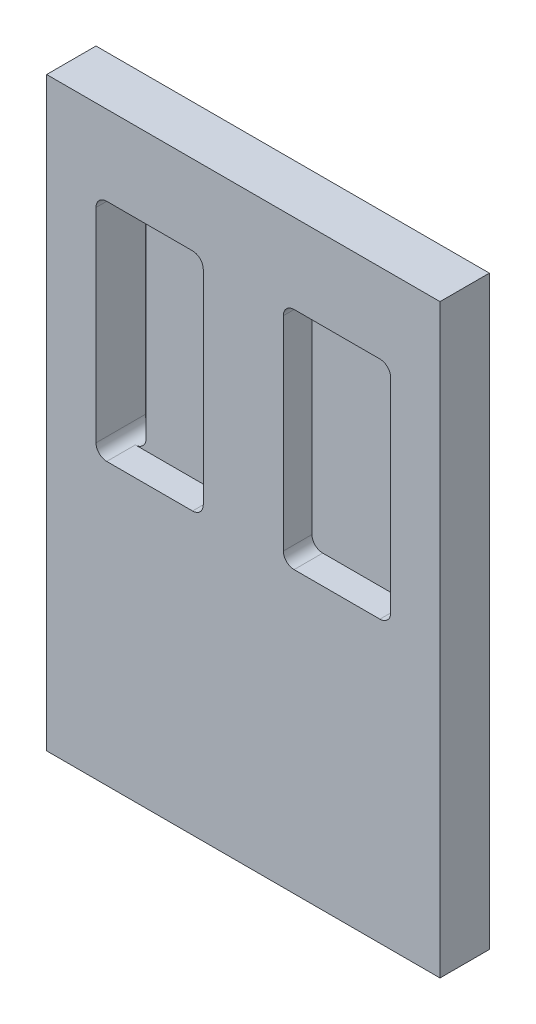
from build123d import *

# Parameters (mm, degrees)
SKETCH1_W           = 69.85
SKETCH1_H           = 104.013
BOSS_EXTRUDE1_DEPTH = 8.763
CUT_EXTRUDE1_START  = -5.08
CUT_EXTRUDE1_DEPTH  = 5.08


with BuildPart() as part:
    # Sketch1 → Boss-Extrude1 (new body)
    with BuildSketch(Plane.XY):
        with Locations((34.925, 52.0065)):
            Rectangle(SKETCH1_W, SKETCH1_H)
        with BuildLine():
            Line((12.573, 87.9475), (12.573, 51.7525))
            ThreePointArc((12.573, 51.7525), (10.668, 49.8475), (8.763, 51.7525))
            Line((8.763, 51.7525), (8.763, 87.9475))
            ThreePointArc((8.763, 87.9475), (10.668, 89.8525), (12.573, 87.9475))
        make_face(mode=Mode.SUBTRACT)
        with BuildLine():
            Line((61.087, 87.9475), (61.087, 51.7525))
            ThreePointArc((61.087, 51.7525), (59.182, 49.8475), (57.277, 51.7525))
            Line((57.277, 51.7525), (57.277, 87.9475))
            ThreePointArc((57.277, 87.9475), (59.182, 89.8525), (61.087, 87.9475))
        make_face(mode=Mode.SUBTRACT)
    extrude(amount=BOSS_EXTRUDE1_DEPTH)

    # Sketch2 → Cut-Extrude1 (cut)
    with BuildSketch(Plane.XY.offset(8.763).offset(CUT_EXTRUDE1_START)):
        with BuildLine():
            Line((10.668, 89.8525), (25.908, 89.8525))
            ThreePointArc((25.908, 89.8525), (27.255038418, 89.294538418), (27.813, 87.9475))
            Line((27.813, 87.9475), (27.813, 51.7525))
            ThreePointArc((27.813, 51.7525), (27.255038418, 50.405461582), (25.908, 49.8475))
            Line((25.908, 49.8475), (10.668, 49.8475))
            ThreePointArc((10.668, 49.8475), (9.320961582, 50.405461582), (8.763, 51.7525))
            Line((8.763, 51.7525), (8.763, 87.9475))
            ThreePointArc((8.763, 87.9475), (9.320961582, 89.294538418), (10.668, 89.8525))
        make_face()
        with BuildLine():
            Line((42.037, 87.9475), (42.037, 51.7525))
            ThreePointArc((42.037, 51.7525), (42.594961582, 50.405461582), (43.942, 49.8475))
            Line((43.942, 49.8475), (59.182, 49.8475))
            ThreePointArc((59.182, 49.8475), (60.529038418, 50.405461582), (61.087, 51.7525))
            Line((61.087, 51.7525), (61.087, 87.9475))
            ThreePointArc((61.087, 87.9475), (60.529038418, 89.294538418), (59.182, 89.8525))
            Line((59.182, 89.8525), (43.942, 89.8525))
            ThreePointArc((43.942, 89.8525), (42.594961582, 89.294538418), (42.037, 87.9475))
        make_face()
    extrude(amount=CUT_EXTRUDE1_DEPTH, mode=Mode.SUBTRACT)


solid = part.part
